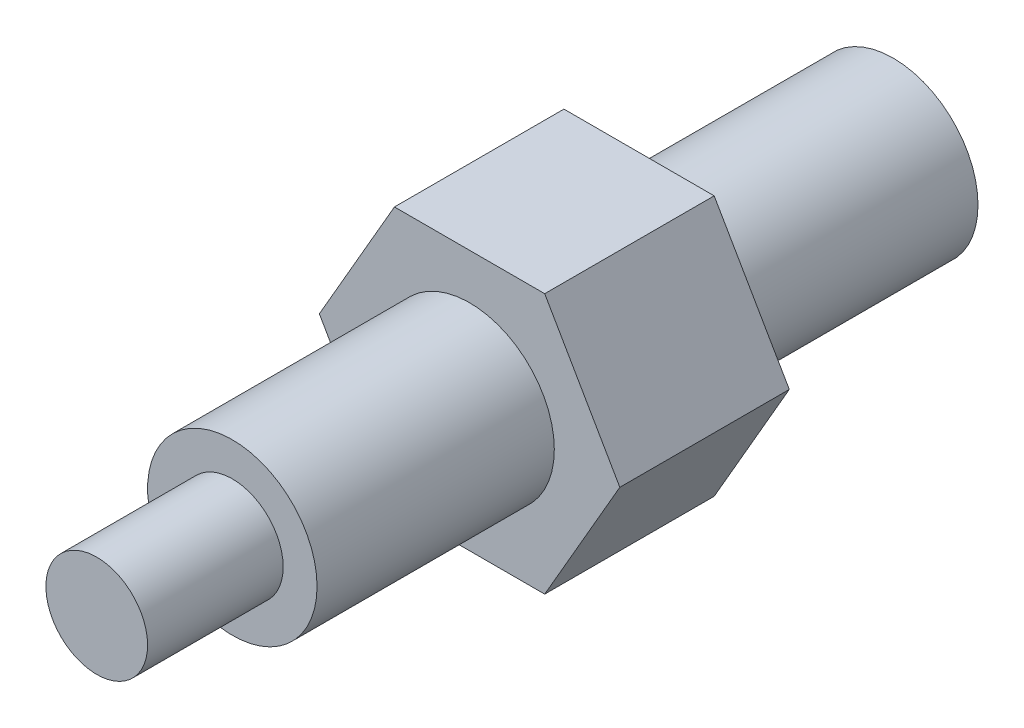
ISO-10303-21;
HEADER;
FILE_DESCRIPTION(('STEP AP214'),'2;1');
FILE_NAME('part.step','',(''),(''),'','','');
FILE_SCHEMA(('AUTOMOTIVE_DESIGN { 1 0 10303 214 1 1 1 1 }'));
ENDSEC;
DATA;
#1=APPLICATION_CONTEXT('core data for automotive mechanical design processes');
#2=APPLICATION_PROTOCOL_DEFINITION('international standard','automotive_design',2000,#1);
#3=PRODUCT_CONTEXT('',#1,'mechanical');
#4=PRODUCT('Part','Part','',(#3));
#5=PRODUCT_RELATED_PRODUCT_CATEGORY('part','',(#4));
#6=PRODUCT_DEFINITION_FORMATION('','',#4);
#7=PRODUCT_DEFINITION_CONTEXT('part definition',#1,'design');
#8=PRODUCT_DEFINITION('design','',#6,#7);
#9=PRODUCT_DEFINITION_SHAPE('','',#8);
#10=(LENGTH_UNIT() NAMED_UNIT(*) SI_UNIT(.MILLI.,.METRE.));
#11=(NAMED_UNIT(*) PLANE_ANGLE_UNIT() SI_UNIT($,.RADIAN.));
#12=(NAMED_UNIT(*) SI_UNIT($,.STERADIAN.) SOLID_ANGLE_UNIT());
#13=UNCERTAINTY_MEASURE_WITH_UNIT(LENGTH_MEASURE(1.E-05),#10,'distance_accuracy_value','');
#14=(GEOMETRIC_REPRESENTATION_CONTEXT(3) GLOBAL_UNCERTAINTY_ASSIGNED_CONTEXT((#13)) GLOBAL_UNIT_ASSIGNED_CONTEXT((#10,
#11,#12)) REPRESENTATION_CONTEXT('',''));
#15=CARTESIAN_POINT('',(0.,0.,0.));
#16=DIRECTION('',(0.,0.,1.));
#17=DIRECTION('',(1.,0.,0.));
#18=AXIS2_PLACEMENT_3D('',#15,#16,#17);
#19=CARTESIAN_POINT('',(13.2978369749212,-7.67750975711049,0.));
#20=DIRECTION('',(0.,0.,1.));
#21=DIRECTION('',(1.,0.,0.));
#22=AXIS2_PLACEMENT_3D('',#19,#20,#21);
#23=PLANE('',#22);
#24=DIRECTION('',(1.,0.,0.));
#25=VECTOR('',#24,1.);
#26=CARTESIAN_POINT('',(-4.43261232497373,-7.6775097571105,0.));
#27=LINE('',#26,#25);
#28=CARTESIAN_POINT('',(-4.43261232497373,-7.6775097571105,0.));
#29=VERTEX_POINT('',#28);
#30=CARTESIAN_POINT('',(4.43261232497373,-7.6775097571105,0.));
#31=VERTEX_POINT('',#30);
#32=EDGE_CURVE('E93',#29,#31,#27,.T.);
#33=ORIENTED_EDGE('',*,*,#32,.F.);
#34=DIRECTION('',(0.5,-0.866025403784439,0.));
#35=VECTOR('',#34,1.);
#36=CARTESIAN_POINT('',(-8.86522464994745,0.,0.));
#37=LINE('',#36,#35);
#38=CARTESIAN_POINT('',(-8.86522464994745,0.,0.));
#39=VERTEX_POINT('',#38);
#40=EDGE_CURVE('E120',#39,#29,#37,.T.);
#41=ORIENTED_EDGE('',*,*,#40,.F.);
#42=DIRECTION('',(-0.5,-0.866025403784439,0.));
#43=VECTOR('',#42,1.);
#44=CARTESIAN_POINT('',(-4.43261232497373,7.6775097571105,0.));
#45=LINE('',#44,#43);
#46=CARTESIAN_POINT('',(-4.43261232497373,7.6775097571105,0.));
#47=VERTEX_POINT('',#46);
#48=EDGE_CURVE('E118',#47,#39,#45,.T.);
#49=ORIENTED_EDGE('',*,*,#48,.F.);
#50=DIRECTION('',(-1.,0.,0.));
#51=VECTOR('',#50,1.);
#52=CARTESIAN_POINT('',(4.43261232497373,7.6775097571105,0.));
#53=LINE('',#52,#51);
#54=CARTESIAN_POINT('',(4.43261232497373,7.6775097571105,0.));
#55=VERTEX_POINT('',#54);
#56=EDGE_CURVE('E116',#55,#47,#53,.T.);
#57=ORIENTED_EDGE('',*,*,#56,.F.);
#58=DIRECTION('',(-0.5,0.866025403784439,0.));
#59=VECTOR('',#58,1.);
#60=CARTESIAN_POINT('',(8.86522464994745,0.,0.));
#61=LINE('',#60,#59);
#62=CARTESIAN_POINT('',(8.86522464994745,0.,0.));
#63=VERTEX_POINT('',#62);
#64=EDGE_CURVE('E95',#63,#55,#61,.T.);
#65=ORIENTED_EDGE('',*,*,#64,.F.);
#66=DIRECTION('',(0.5,0.866025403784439,0.));
#67=VECTOR('',#66,1.);
#68=CARTESIAN_POINT('',(4.43261232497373,-7.6775097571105,0.));
#69=LINE('',#68,#67);
#70=EDGE_CURVE('E88',#31,#63,#69,.T.);
#71=ORIENTED_EDGE('',*,*,#70,.F.);
#72=EDGE_LOOP('',(#33,#41,#49,#57,#65,#71));
#73=FACE_BOUND('',#72,.T.);
#74=CARTESIAN_POINT('',(0.,0.,0.));
#75=DIRECTION('',(0.,0.,1.));
#76=DIRECTION('',(1.,0.,0.));
#77=AXIS2_PLACEMENT_3D('',#74,#75,#76);
#78=CIRCLE('',#77,5.);
#79=CARTESIAN_POINT('',(5.,0.,0.));
#80=VERTEX_POINT('',#79);
#81=EDGE_CURVE('E11',#80,#80,#78,.F.);
#82=ORIENTED_EDGE('',*,*,#81,.F.);
#83=EDGE_LOOP('',(#82));
#84=FACE_BOUND('',#83,.T.);
#85=ADVANCED_FACE('F35',(#73,#84),#23,.F.);
#86=CARTESIAN_POINT('',(0.,0.,24.));
#87=DIRECTION('',(0.,0.,1.));
#88=DIRECTION('',(1.,0.,0.));
#89=AXIS2_PLACEMENT_3D('',#86,#87,#88);
#90=PLANE('',#89);
#91=CARTESIAN_POINT('',(0.,0.,24.));
#92=DIRECTION('',(0.,0.,1.));
#93=DIRECTION('',(1.,0.,0.));
#94=AXIS2_PLACEMENT_3D('',#91,#92,#93);
#95=CIRCLE('',#94,5.);
#96=CARTESIAN_POINT('',(5.,0.,24.));
#97=VERTEX_POINT('',#96);
#98=EDGE_CURVE('E108',#97,#97,#95,.T.);
#99=ORIENTED_EDGE('',*,*,#98,.T.);
#100=EDGE_LOOP('',(#99));
#101=FACE_BOUND('',#100,.T.);
#102=CARTESIAN_POINT('',(0.,0.,24.));
#103=DIRECTION('',(0.,0.,1.));
#104=DIRECTION('',(1.,0.,0.));
#105=AXIS2_PLACEMENT_3D('',#102,#103,#104);
#106=CIRCLE('',#105,3.);
#107=CARTESIAN_POINT('',(3.,0.,24.));
#108=VERTEX_POINT('',#107);
#109=EDGE_CURVE('E256',#108,#108,#106,.T.);
#110=ORIENTED_EDGE('',*,*,#109,.F.);
#111=EDGE_LOOP('',(#110));
#112=FACE_BOUND('',#111,.T.);
#113=ADVANCED_FACE('F169',(#101,#112),#90,.T.);
#114=CARTESIAN_POINT('',(13.2978369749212,-7.67750975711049,10.));
#115=DIRECTION('',(0.,0.,1.));
#116=DIRECTION('',(1.,0.,0.));
#117=AXIS2_PLACEMENT_3D('',#114,#115,#116);
#118=PLANE('',#117);
#119=DIRECTION('',(1.,0.,0.));
#120=VECTOR('',#119,1.);
#121=CARTESIAN_POINT('',(-4.43261232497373,-7.6775097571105,10.));
#122=LINE('',#121,#120);
#123=CARTESIAN_POINT('',(-4.43261232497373,-7.6775097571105,10.));
#124=VERTEX_POINT('',#123);
#125=CARTESIAN_POINT('',(4.43261232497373,-7.6775097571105,10.));
#126=VERTEX_POINT('',#125);
#127=EDGE_CURVE('E122',#124,#126,#122,.T.);
#128=ORIENTED_EDGE('',*,*,#127,.T.);
#129=DIRECTION('',(0.5,0.866025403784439,0.));
#130=VECTOR('',#129,1.);
#131=CARTESIAN_POINT('',(4.43261232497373,-7.6775097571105,10.));
#132=LINE('',#131,#130);
#133=CARTESIAN_POINT('',(8.86522464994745,0.,10.));
#134=VERTEX_POINT('',#133);
#135=EDGE_CURVE('E102',#126,#134,#132,.T.);
#136=ORIENTED_EDGE('',*,*,#135,.T.);
#137=DIRECTION('',(-0.5,0.866025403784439,0.));
#138=VECTOR('',#137,1.);
#139=CARTESIAN_POINT('',(8.86522464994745,0.,10.));
#140=LINE('',#139,#138);
#141=CARTESIAN_POINT('',(4.43261232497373,7.6775097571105,10.));
#142=VERTEX_POINT('',#141);
#143=EDGE_CURVE('E125',#134,#142,#140,.T.);
#144=ORIENTED_EDGE('',*,*,#143,.T.);
#145=DIRECTION('',(-1.,0.,0.));
#146=VECTOR('',#145,1.);
#147=CARTESIAN_POINT('',(4.43261232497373,7.6775097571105,10.));
#148=LINE('',#147,#146);
#149=CARTESIAN_POINT('',(-4.43261232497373,7.6775097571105,10.));
#150=VERTEX_POINT('',#149);
#151=EDGE_CURVE('E127',#142,#150,#148,.T.);
#152=ORIENTED_EDGE('',*,*,#151,.T.);
#153=DIRECTION('',(-0.5,-0.866025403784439,0.));
#154=VECTOR('',#153,1.);
#155=CARTESIAN_POINT('',(-4.43261232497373,7.6775097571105,10.));
#156=LINE('',#155,#154);
#157=CARTESIAN_POINT('',(-8.86522464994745,0.,10.));
#158=VERTEX_POINT('',#157);
#159=EDGE_CURVE('E55',#150,#158,#156,.T.);
#160=ORIENTED_EDGE('',*,*,#159,.T.);
#161=DIRECTION('',(0.5,-0.866025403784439,0.));
#162=VECTOR('',#161,1.);
#163=CARTESIAN_POINT('',(-8.86522464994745,0.,10.));
#164=LINE('',#163,#162);
#165=EDGE_CURVE('E50',#158,#124,#164,.T.);
#166=ORIENTED_EDGE('',*,*,#165,.T.);
#167=EDGE_LOOP('',(#128,#136,#144,#152,#160,#166));
#168=FACE_BOUND('',#167,.T.);
#169=CARTESIAN_POINT('',(0.,0.,10.));
#170=DIRECTION('',(0.,0.,1.));
#171=DIRECTION('',(1.,0.,0.));
#172=AXIS2_PLACEMENT_3D('',#169,#170,#171);
#173=CIRCLE('',#172,5.);
#174=CARTESIAN_POINT('',(5.,0.,10.));
#175=VERTEX_POINT('',#174);
#176=EDGE_CURVE('E111',#175,#175,#173,.T.);
#177=ORIENTED_EDGE('',*,*,#176,.F.);
#178=EDGE_LOOP('',(#177));
#179=FACE_BOUND('',#178,.T.);
#180=ADVANCED_FACE('F146',(#168,#179),#118,.T.);
#181=CARTESIAN_POINT('',(-4.43261232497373,-7.6775097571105,10.));
#182=DIRECTION('',(0.,1.,0.));
#183=DIRECTION('',(-1.,0.,0.));
#184=AXIS2_PLACEMENT_3D('',#181,#182,#183);
#185=PLANE('',#184);
#186=ORIENTED_EDGE('',*,*,#32,.T.);
#187=DIRECTION('',(0.,0.,-1.));
#188=VECTOR('',#187,1.);
#189=CARTESIAN_POINT('',(4.43261232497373,-7.6775097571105,10.));
#190=LINE('',#189,#188);
#191=EDGE_CURVE('E43',#126,#31,#190,.T.);
#192=ORIENTED_EDGE('',*,*,#191,.F.);
#193=ORIENTED_EDGE('',*,*,#127,.F.);
#194=DIRECTION('',(0.,0.,-1.));
#195=VECTOR('',#194,1.);
#196=CARTESIAN_POINT('',(-4.43261232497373,-7.6775097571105,10.));
#197=LINE('',#196,#195);
#198=EDGE_CURVE('E107',#124,#29,#197,.T.);
#199=ORIENTED_EDGE('',*,*,#198,.T.);
#200=EDGE_LOOP('',(#186,#192,#193,#199));
#201=FACE_BOUND('',#200,.T.);
#202=ADVANCED_FACE('F37',(#201),#185,.F.);
#203=CARTESIAN_POINT('',(4.43261232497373,-7.6775097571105,10.));
#204=DIRECTION('',(-0.866025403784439,0.5,0.));
#205=DIRECTION('',(-0.5,-0.866025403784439,0.));
#206=AXIS2_PLACEMENT_3D('',#203,#204,#205);
#207=PLANE('',#206);
#208=ORIENTED_EDGE('',*,*,#70,.T.);
#209=DIRECTION('',(0.,0.,-1.));
#210=VECTOR('',#209,1.);
#211=CARTESIAN_POINT('',(8.86522464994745,0.,10.));
#212=LINE('',#211,#210);
#213=EDGE_CURVE('E105',#134,#63,#212,.T.);
#214=ORIENTED_EDGE('',*,*,#213,.F.);
#215=ORIENTED_EDGE('',*,*,#135,.F.);
#216=ORIENTED_EDGE('',*,*,#191,.T.);
#217=EDGE_LOOP('',(#208,#214,#215,#216));
#218=FACE_BOUND('',#217,.T.);
#219=ADVANCED_FACE('F101',(#218),#207,.F.);
#220=CARTESIAN_POINT('',(8.86522464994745,0.,10.));
#221=DIRECTION('',(-0.866025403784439,-0.5,0.));
#222=DIRECTION('',(0.5,-0.866025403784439,0.));
#223=AXIS2_PLACEMENT_3D('',#220,#221,#222);
#224=PLANE('',#223);
#225=ORIENTED_EDGE('',*,*,#64,.T.);
#226=DIRECTION('',(0.,0.,-1.));
#227=VECTOR('',#226,1.);
#228=CARTESIAN_POINT('',(4.43261232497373,7.6775097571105,10.));
#229=LINE('',#228,#227);
#230=EDGE_CURVE('E138',#142,#55,#229,.T.);
#231=ORIENTED_EDGE('',*,*,#230,.F.);
#232=ORIENTED_EDGE('',*,*,#143,.F.);
#233=ORIENTED_EDGE('',*,*,#213,.T.);
#234=EDGE_LOOP('',(#225,#231,#232,#233));
#235=FACE_BOUND('',#234,.T.);
#236=ADVANCED_FACE('F143',(#235),#224,.F.);
#237=CARTESIAN_POINT('',(4.43261232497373,7.6775097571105,10.));
#238=DIRECTION('',(0.,-1.,0.));
#239=DIRECTION('',(0.,0.,-1.));
#240=AXIS2_PLACEMENT_3D('',#237,#238,#239);
#241=PLANE('',#240);
#242=ORIENTED_EDGE('',*,*,#56,.T.);
#243=DIRECTION('',(0.,0.,-1.));
#244=VECTOR('',#243,1.);
#245=CARTESIAN_POINT('',(-4.43261232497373,7.6775097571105,10.));
#246=LINE('',#245,#244);
#247=EDGE_CURVE('E135',#150,#47,#246,.T.);
#248=ORIENTED_EDGE('',*,*,#247,.F.);
#249=ORIENTED_EDGE('',*,*,#151,.F.);
#250=ORIENTED_EDGE('',*,*,#230,.T.);
#251=EDGE_LOOP('',(#242,#248,#249,#250));
#252=FACE_BOUND('',#251,.T.);
#253=ADVANCED_FACE('F150',(#252),#241,.F.);
#254=CARTESIAN_POINT('',(-4.43261232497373,7.6775097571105,10.));
#255=DIRECTION('',(0.866025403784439,-0.5,0.));
#256=DIRECTION('',(0.5,0.866025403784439,0.));
#257=AXIS2_PLACEMENT_3D('',#254,#255,#256);
#258=PLANE('',#257);
#259=ORIENTED_EDGE('',*,*,#48,.T.);
#260=DIRECTION('',(0.,0.,-1.));
#261=VECTOR('',#260,1.);
#262=CARTESIAN_POINT('',(-8.86522464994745,0.,10.));
#263=LINE('',#262,#261);
#264=EDGE_CURVE('E132',#158,#39,#263,.T.);
#265=ORIENTED_EDGE('',*,*,#264,.F.);
#266=ORIENTED_EDGE('',*,*,#159,.F.);
#267=ORIENTED_EDGE('',*,*,#247,.T.);
#268=EDGE_LOOP('',(#259,#265,#266,#267));
#269=FACE_BOUND('',#268,.T.);
#270=ADVANCED_FACE('F153',(#269),#258,.F.);
#271=CARTESIAN_POINT('',(-8.86522464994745,0.,10.));
#272=DIRECTION('',(0.866025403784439,0.5,0.));
#273=DIRECTION('',(-0.5,0.866025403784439,0.));
#274=AXIS2_PLACEMENT_3D('',#271,#272,#273);
#275=PLANE('',#274);
#276=ORIENTED_EDGE('',*,*,#40,.T.);
#277=ORIENTED_EDGE('',*,*,#198,.F.);
#278=ORIENTED_EDGE('',*,*,#165,.F.);
#279=ORIENTED_EDGE('',*,*,#264,.T.);
#280=EDGE_LOOP('',(#276,#277,#278,#279));
#281=FACE_BOUND('',#280,.T.);
#282=ADVANCED_FACE('F155',(#281),#275,.F.);
#283=CARTESIAN_POINT('',(0.,0.,24.));
#284=DIRECTION('',(0.,0.,-1.));
#285=DIRECTION('',(-1.,0.,0.));
#286=AXIS2_PLACEMENT_3D('',#283,#284,#285);
#287=CYLINDRICAL_SURFACE('',#286,5.);
#288=ORIENTED_EDGE('',*,*,#98,.F.);
#289=EDGE_LOOP('',(#288));
#290=FACE_BOUND('',#289,.T.);
#291=ORIENTED_EDGE('',*,*,#176,.T.);
#292=EDGE_LOOP('',(#291));
#293=FACE_BOUND('',#292,.T.);
#294=ADVANCED_FACE('F157',(#290,#293),#287,.T.);
#295=CARTESIAN_POINT('',(0.,0.,32.));
#296=DIRECTION('',(0.,0.,-1.));
#297=DIRECTION('',(-1.,0.,0.));
#298=AXIS2_PLACEMENT_3D('',#295,#296,#297);
#299=CYLINDRICAL_SURFACE('',#298,3.);
#300=CARTESIAN_POINT('',(0.,0.,32.));
#301=DIRECTION('',(0.,0.,1.));
#302=DIRECTION('',(1.,0.,0.));
#303=AXIS2_PLACEMENT_3D('',#300,#301,#302);
#304=CIRCLE('',#303,3.);
#305=CARTESIAN_POINT('',(3.,0.,32.));
#306=VERTEX_POINT('',#305);
#307=EDGE_CURVE('E259',#306,#306,#304,.T.);
#308=ORIENTED_EDGE('',*,*,#307,.F.);
#309=EDGE_LOOP('',(#308));
#310=FACE_BOUND('',#309,.T.);
#311=ORIENTED_EDGE('',*,*,#109,.T.);
#312=EDGE_LOOP('',(#311));
#313=FACE_BOUND('',#312,.T.);
#314=ADVANCED_FACE('F163',(#310,#313),#299,.T.);
#315=CARTESIAN_POINT('',(0.,0.,32.));
#316=DIRECTION('',(0.,0.,1.));
#317=DIRECTION('',(1.,0.,0.));
#318=AXIS2_PLACEMENT_3D('',#315,#316,#317);
#319=PLANE('',#318);
#320=ORIENTED_EDGE('',*,*,#307,.T.);
#321=EDGE_LOOP('',(#320));
#322=FACE_BOUND('',#321,.T.);
#323=ADVANCED_FACE('F218',(#322),#319,.T.);
#324=CARTESIAN_POINT('',(0.,0.,-15.));
#325=DIRECTION('',(0.,0.,1.));
#326=DIRECTION('',(1.,0.,0.));
#327=AXIS2_PLACEMENT_3D('',#324,#325,#326);
#328=CYLINDRICAL_SURFACE('',#327,5.);
#329=CARTESIAN_POINT('',(0.,0.,-15.));
#330=DIRECTION('',(0.,0.,-1.));
#331=DIRECTION('',(-1.,0.,0.));
#332=AXIS2_PLACEMENT_3D('',#329,#330,#331);
#333=CIRCLE('',#332,5.);
#334=CARTESIAN_POINT('',(-5.,0.,-15.));
#335=VERTEX_POINT('',#334);
#336=EDGE_CURVE('E255',#335,#335,#333,.T.);
#337=ORIENTED_EDGE('',*,*,#336,.F.);
#338=EDGE_LOOP('',(#337));
#339=FACE_BOUND('',#338,.T.);
#340=ORIENTED_EDGE('',*,*,#81,.T.);
#341=EDGE_LOOP('',(#340));
#342=FACE_BOUND('',#341,.T.);
#343=ADVANCED_FACE('F228',(#339,#342),#328,.T.);
#344=CARTESIAN_POINT('',(0.,0.,-15.));
#345=DIRECTION('',(0.,0.,-1.));
#346=DIRECTION('',(-1.,0.,0.));
#347=AXIS2_PLACEMENT_3D('',#344,#345,#346);
#348=PLANE('',#347);
#349=ORIENTED_EDGE('',*,*,#336,.T.);
#350=EDGE_LOOP('',(#349));
#351=FACE_BOUND('',#350,.T.);
#352=ADVANCED_FACE('F239',(#351),#348,.T.);
#353=CLOSED_SHELL('',(#85,#113,#180,#202,#219,#236,#253,#270,#282,#294,#314,#323,#343,#352));
#354=MANIFOLD_SOLID_BREP('B2',#353);
#355=ADVANCED_BREP_SHAPE_REPRESENTATION('',(#18,#354),#14);
#356=SHAPE_DEFINITION_REPRESENTATION(#9,#355);
ENDSEC;
END-ISO-10303-21;
